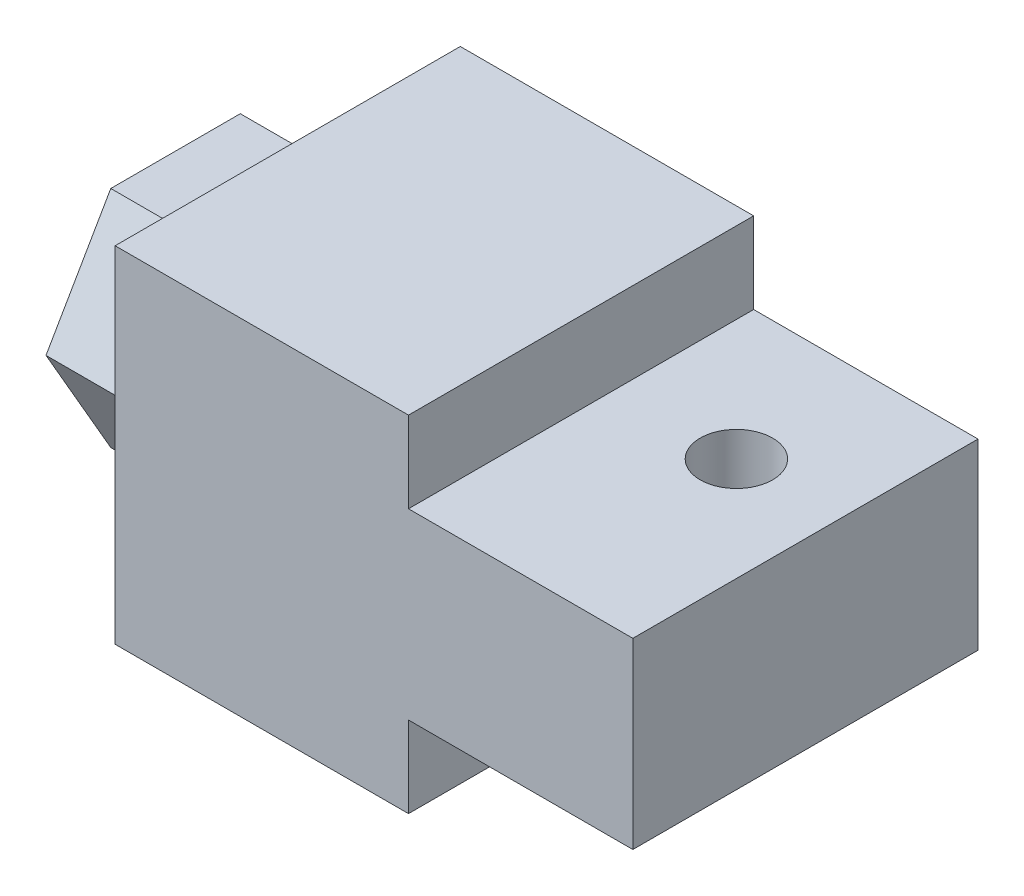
ISO-10303-21;
HEADER;
FILE_DESCRIPTION(('STEP AP214'),'2;1');
FILE_NAME('part.step','',(''),(''),'','','');
FILE_SCHEMA(('AUTOMOTIVE_DESIGN { 1 0 10303 214 1 1 1 1 }'));
ENDSEC;
DATA;
#1=APPLICATION_CONTEXT('core data for automotive mechanical design processes');
#2=APPLICATION_PROTOCOL_DEFINITION('international standard','automotive_design',2000,#1);
#3=PRODUCT_CONTEXT('',#1,'mechanical');
#4=PRODUCT('Part','Part','',(#3));
#5=PRODUCT_RELATED_PRODUCT_CATEGORY('part','',(#4));
#6=PRODUCT_DEFINITION_FORMATION('','',#4);
#7=PRODUCT_DEFINITION_CONTEXT('part definition',#1,'design');
#8=PRODUCT_DEFINITION('design','',#6,#7);
#9=PRODUCT_DEFINITION_SHAPE('','',#8);
#10=(LENGTH_UNIT() NAMED_UNIT(*) SI_UNIT(.MILLI.,.METRE.));
#11=(NAMED_UNIT(*) PLANE_ANGLE_UNIT() SI_UNIT($,.RADIAN.));
#12=(NAMED_UNIT(*) SI_UNIT($,.STERADIAN.) SOLID_ANGLE_UNIT());
#13=UNCERTAINTY_MEASURE_WITH_UNIT(LENGTH_MEASURE(1.E-05),#10,'distance_accuracy_value','');
#14=(GEOMETRIC_REPRESENTATION_CONTEXT(3) GLOBAL_UNCERTAINTY_ASSIGNED_CONTEXT((#13)) GLOBAL_UNIT_ASSIGNED_CONTEXT((#10,
#11,#12)) REPRESENTATION_CONTEXT('',''));
#15=CARTESIAN_POINT('',(0.,0.,0.));
#16=DIRECTION('',(0.,0.,1.));
#17=DIRECTION('',(1.,0.,0.));
#18=AXIS2_PLACEMENT_3D('',#15,#16,#17);
#19=CARTESIAN_POINT('',(30.,10.,10.));
#20=DIRECTION('',(0.,1.,0.));
#21=DIRECTION('',(0.,0.,-1.));
#22=AXIS2_PLACEMENT_3D('',#19,#20,#21);
#23=PLANE('',#22);
#24=DIRECTION('',(-1.,0.,0.));
#25=VECTOR('',#24,1.);
#26=CARTESIAN_POINT('',(30.,10.,10.));
#27=LINE('',#26,#25);
#28=CARTESIAN_POINT('',(17.,10.,10.));
#29=VERTEX_POINT('',#28);
#30=CARTESIAN_POINT('',(0.,10.,10.));
#31=VERTEX_POINT('',#30);
#32=EDGE_CURVE('E23',#29,#31,#27,.T.);
#33=ORIENTED_EDGE('',*,*,#32,.F.);
#34=DIRECTION('',(0.,0.,-1.));
#35=VECTOR('',#34,1.);
#36=CARTESIAN_POINT('',(17.,10.,10.));
#37=LINE('',#36,#35);
#38=CARTESIAN_POINT('',(17.,10.,-10.));
#39=VERTEX_POINT('',#38);
#40=EDGE_CURVE('E193',#29,#39,#37,.T.);
#41=ORIENTED_EDGE('',*,*,#40,.T.);
#42=DIRECTION('',(-1.,0.,0.));
#43=VECTOR('',#42,1.);
#44=CARTESIAN_POINT('',(30.,10.,-10.));
#45=LINE('',#44,#43);
#46=CARTESIAN_POINT('',(0.,10.,-10.));
#47=VERTEX_POINT('',#46);
#48=EDGE_CURVE('E227',#39,#47,#45,.T.);
#49=ORIENTED_EDGE('',*,*,#48,.T.);
#50=DIRECTION('',(0.,0.,-1.));
#51=VECTOR('',#50,1.);
#52=CARTESIAN_POINT('',(0.,10.,10.));
#53=LINE('',#52,#51);
#54=EDGE_CURVE('E210',#31,#47,#53,.T.);
#55=ORIENTED_EDGE('',*,*,#54,.F.);
#56=EDGE_LOOP('',(#33,#41,#49,#55));
#57=FACE_BOUND('',#56,.T.);
#58=ADVANCED_FACE('F14',(#57),#23,.T.);
#59=CARTESIAN_POINT('',(30.,10.,10.));
#60=DIRECTION('',(0.,0.,-1.));
#61=DIRECTION('',(1.,0.,0.));
#62=AXIS2_PLACEMENT_3D('',#59,#60,#61);
#63=PLANE('',#62);
#64=DIRECTION('',(0.,1.,0.));
#65=VECTOR('',#64,1.);
#66=CARTESIAN_POINT('',(17.,5.3,10.));
#67=LINE('',#66,#65);
#68=CARTESIAN_POINT('',(17.,5.3,10.));
#69=VERTEX_POINT('',#68);
#70=EDGE_CURVE('E181',#69,#29,#67,.T.);
#71=ORIENTED_EDGE('',*,*,#70,.T.);
#72=ORIENTED_EDGE('',*,*,#32,.T.);
#73=DIRECTION('',(0.,-1.,0.));
#74=VECTOR('',#73,1.);
#75=CARTESIAN_POINT('',(0.,10.,10.));
#76=LINE('',#75,#74);
#77=CARTESIAN_POINT('',(0.,-10.,10.));
#78=VERTEX_POINT('',#77);
#79=EDGE_CURVE('E219',#31,#78,#76,.T.);
#80=ORIENTED_EDGE('',*,*,#79,.T.);
#81=DIRECTION('',(-1.,0.,0.));
#82=VECTOR('',#81,1.);
#83=CARTESIAN_POINT('',(30.,-10.,10.));
#84=LINE('',#83,#82);
#85=CARTESIAN_POINT('',(17.,-10.,10.));
#86=VERTEX_POINT('',#85);
#87=EDGE_CURVE('E231',#86,#78,#84,.T.);
#88=ORIENTED_EDGE('',*,*,#87,.F.);
#89=DIRECTION('',(0.,-1.,0.));
#90=VECTOR('',#89,1.);
#91=CARTESIAN_POINT('',(17.,-5.3,10.));
#92=LINE('',#91,#90);
#93=CARTESIAN_POINT('',(17.,-5.3,10.));
#94=VERTEX_POINT('',#93);
#95=EDGE_CURVE('E196',#94,#86,#92,.T.);
#96=ORIENTED_EDGE('',*,*,#95,.F.);
#97=DIRECTION('',(1.,0.,0.));
#98=VECTOR('',#97,1.);
#99=CARTESIAN_POINT('',(17.,-5.3,10.));
#100=LINE('',#99,#98);
#101=CARTESIAN_POINT('',(30.,-5.3,10.));
#102=VERTEX_POINT('',#101);
#103=EDGE_CURVE('E198',#94,#102,#100,.T.);
#104=ORIENTED_EDGE('',*,*,#103,.T.);
#105=DIRECTION('',(0.,-1.,0.));
#106=VECTOR('',#105,1.);
#107=CARTESIAN_POINT('',(30.,10.,10.));
#108=LINE('',#107,#106);
#109=CARTESIAN_POINT('',(30.,5.3,10.));
#110=VERTEX_POINT('',#109);
#111=EDGE_CURVE('E225',#110,#102,#108,.T.);
#112=ORIENTED_EDGE('',*,*,#111,.F.);
#113=DIRECTION('',(1.,0.,0.));
#114=VECTOR('',#113,1.);
#115=CARTESIAN_POINT('',(17.,5.3,10.));
#116=LINE('',#115,#114);
#117=EDGE_CURVE('E184',#69,#110,#116,.T.);
#118=ORIENTED_EDGE('',*,*,#117,.F.);
#119=EDGE_LOOP('',(#71,#72,#80,#88,#96,#104,#112,#118));
#120=FACE_BOUND('',#119,.T.);
#121=ADVANCED_FACE('F16',(#120),#63,.F.);
#122=CARTESIAN_POINT('',(30.,-10.,-10.));
#123=DIRECTION('',(0.,0.,1.));
#124=DIRECTION('',(0.,1.,0.));
#125=AXIS2_PLACEMENT_3D('',#122,#123,#124);
#126=PLANE('',#125);
#127=DIRECTION('',(0.,1.,0.));
#128=VECTOR('',#127,1.);
#129=CARTESIAN_POINT('',(17.,5.3,-10.));
#130=LINE('',#129,#128);
#131=CARTESIAN_POINT('',(17.,5.3,-10.));
#132=VERTEX_POINT('',#131);
#133=EDGE_CURVE('E186',#132,#39,#130,.T.);
#134=ORIENTED_EDGE('',*,*,#133,.F.);
#135=DIRECTION('',(1.,0.,0.));
#136=VECTOR('',#135,1.);
#137=CARTESIAN_POINT('',(17.,5.3,-10.));
#138=LINE('',#137,#136);
#139=CARTESIAN_POINT('',(30.,5.3,-10.));
#140=VERTEX_POINT('',#139);
#141=EDGE_CURVE('E188',#132,#140,#138,.T.);
#142=ORIENTED_EDGE('',*,*,#141,.T.);
#143=DIRECTION('',(0.,1.,0.));
#144=VECTOR('',#143,1.);
#145=CARTESIAN_POINT('',(30.,-10.,-10.));
#146=LINE('',#145,#144);
#147=CARTESIAN_POINT('',(30.,-5.3,-10.));
#148=VERTEX_POINT('',#147);
#149=EDGE_CURVE('E222',#148,#140,#146,.T.);
#150=ORIENTED_EDGE('',*,*,#149,.F.);
#151=DIRECTION('',(1.,0.,0.));
#152=VECTOR('',#151,1.);
#153=CARTESIAN_POINT('',(17.,-5.3,-10.));
#154=LINE('',#153,#152);
#155=CARTESIAN_POINT('',(17.,-5.3,-10.));
#156=VERTEX_POINT('',#155);
#157=EDGE_CURVE('E204',#156,#148,#154,.T.);
#158=ORIENTED_EDGE('',*,*,#157,.F.);
#159=DIRECTION('',(0.,-1.,0.));
#160=VECTOR('',#159,1.);
#161=CARTESIAN_POINT('',(17.,-5.3,-10.));
#162=LINE('',#161,#160);
#163=CARTESIAN_POINT('',(17.,-10.,-10.));
#164=VERTEX_POINT('',#163);
#165=EDGE_CURVE('E201',#156,#164,#162,.T.);
#166=ORIENTED_EDGE('',*,*,#165,.T.);
#167=DIRECTION('',(-1.,0.,0.));
#168=VECTOR('',#167,1.);
#169=CARTESIAN_POINT('',(30.,-10.,-10.));
#170=LINE('',#169,#168);
#171=CARTESIAN_POINT('',(0.,-10.,-10.));
#172=VERTEX_POINT('',#171);
#173=EDGE_CURVE('E229',#164,#172,#170,.T.);
#174=ORIENTED_EDGE('',*,*,#173,.T.);
#175=DIRECTION('',(0.,1.,0.));
#176=VECTOR('',#175,1.);
#177=CARTESIAN_POINT('',(0.,-10.,-10.));
#178=LINE('',#177,#176);
#179=EDGE_CURVE('E213',#172,#47,#178,.T.);
#180=ORIENTED_EDGE('',*,*,#179,.T.);
#181=ORIENTED_EDGE('',*,*,#48,.F.);
#182=EDGE_LOOP('',(#134,#142,#150,#158,#166,#174,#180,#181));
#183=FACE_BOUND('',#182,.T.);
#184=ADVANCED_FACE('F263',(#183),#126,.F.);
#185=CARTESIAN_POINT('',(30.,10.,-10.));
#186=DIRECTION('',(1.,0.,0.));
#187=DIRECTION('',(0.,1.,0.));
#188=AXIS2_PLACEMENT_3D('',#185,#186,#187);
#189=PLANE('',#188);
#190=DIRECTION('',(0.,0.,-1.));
#191=VECTOR('',#190,1.);
#192=CARTESIAN_POINT('',(30.,5.3,-10.));
#193=LINE('',#192,#191);
#194=EDGE_CURVE('E38',#110,#140,#193,.T.);
#195=ORIENTED_EDGE('',*,*,#194,.F.);
#196=ORIENTED_EDGE('',*,*,#111,.T.);
#197=DIRECTION('',(0.,0.,-1.));
#198=VECTOR('',#197,1.);
#199=CARTESIAN_POINT('',(30.,-5.3,-10.));
#200=LINE('',#199,#198);
#201=EDGE_CURVE('E9',#102,#148,#200,.T.);
#202=ORIENTED_EDGE('',*,*,#201,.T.);
#203=ORIENTED_EDGE('',*,*,#149,.T.);
#204=EDGE_LOOP('',(#195,#196,#202,#203));
#205=FACE_BOUND('',#204,.T.);
#206=ADVANCED_FACE('F260',(#205),#189,.T.);
#207=CARTESIAN_POINT('',(30.,-10.,-10.));
#208=DIRECTION('',(0.,-1.,0.));
#209=DIRECTION('',(1.,0.,0.));
#210=AXIS2_PLACEMENT_3D('',#207,#208,#209);
#211=PLANE('',#210);
#212=DIRECTION('',(0.,0.,-1.));
#213=VECTOR('',#212,1.);
#214=CARTESIAN_POINT('',(17.,-10.,-10.));
#215=LINE('',#214,#213);
#216=EDGE_CURVE('E208',#86,#164,#215,.T.);
#217=ORIENTED_EDGE('',*,*,#216,.F.);
#218=ORIENTED_EDGE('',*,*,#87,.T.);
#219=DIRECTION('',(0.,0.,1.));
#220=VECTOR('',#219,1.);
#221=CARTESIAN_POINT('',(0.,-10.,-10.));
#222=LINE('',#221,#220);
#223=EDGE_CURVE('E216',#172,#78,#222,.T.);
#224=ORIENTED_EDGE('',*,*,#223,.F.);
#225=ORIENTED_EDGE('',*,*,#173,.F.);
#226=EDGE_LOOP('',(#217,#218,#224,#225));
#227=FACE_BOUND('',#226,.T.);
#228=ADVANCED_FACE('F247',(#227),#211,.T.);
#229=CARTESIAN_POINT('',(0.,10.,-10.));
#230=DIRECTION('',(1.,0.,0.));
#231=DIRECTION('',(0.,1.,0.));
#232=AXIS2_PLACEMENT_3D('',#229,#230,#231);
#233=PLANE('',#232);
#234=DIRECTION('',(0.,0.,-1.));
#235=VECTOR('',#234,1.);
#236=CARTESIAN_POINT('',(0.,-6.5,3.75277674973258));
#237=LINE('',#236,#235);
#238=CARTESIAN_POINT('',(0.,-6.5,3.75277674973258));
#239=VERTEX_POINT('',#238);
#240=CARTESIAN_POINT('',(0.,-6.5,-3.75277674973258));
#241=VERTEX_POINT('',#240);
#242=EDGE_CURVE('E139',#239,#241,#237,.T.);
#243=ORIENTED_EDGE('',*,*,#242,.T.);
#244=DIRECTION('',(0.,0.866025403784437,-0.5));
#245=VECTOR('',#244,1.);
#246=CARTESIAN_POINT('',(0.,-6.5,-3.75277674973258));
#247=LINE('',#246,#245);
#248=CARTESIAN_POINT('',(0.,0.,-7.50555349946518));
#249=VERTEX_POINT('',#248);
#250=EDGE_CURVE('E30',#241,#249,#247,.T.);
#251=ORIENTED_EDGE('',*,*,#250,.T.);
#252=DIRECTION('',(0.,-0.866025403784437,-0.5));
#253=VECTOR('',#252,1.);
#254=CARTESIAN_POINT('',(0.,6.5,-3.75277674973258));
#255=LINE('',#254,#253);
#256=CARTESIAN_POINT('',(0.,6.5,-3.75277674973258));
#257=VERTEX_POINT('',#256);
#258=EDGE_CURVE('E127',#257,#249,#255,.T.);
#259=ORIENTED_EDGE('',*,*,#258,.F.);
#260=DIRECTION('',(0.,0.,-1.));
#261=VECTOR('',#260,1.);
#262=CARTESIAN_POINT('',(0.,6.5,3.75277674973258));
#263=LINE('',#262,#261);
#264=CARTESIAN_POINT('',(0.,6.5,3.75277674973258));
#265=VERTEX_POINT('',#264);
#266=EDGE_CURVE('E132',#265,#257,#263,.T.);
#267=ORIENTED_EDGE('',*,*,#266,.F.);
#268=DIRECTION('',(0.,-0.866025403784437,0.5));
#269=VECTOR('',#268,1.);
#270=CARTESIAN_POINT('',(0.,6.5,3.75277674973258));
#271=LINE('',#270,#269);
#272=CARTESIAN_POINT('',(0.,0.,7.50555349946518));
#273=VERTEX_POINT('',#272);
#274=EDGE_CURVE('E148',#265,#273,#271,.T.);
#275=ORIENTED_EDGE('',*,*,#274,.T.);
#276=DIRECTION('',(0.,0.866025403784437,0.5));
#277=VECTOR('',#276,1.);
#278=CARTESIAN_POINT('',(0.,-6.5,3.75277674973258));
#279=LINE('',#278,#277);
#280=EDGE_CURVE('E151',#239,#273,#279,.T.);
#281=ORIENTED_EDGE('',*,*,#280,.F.);
#282=EDGE_LOOP('',(#243,#251,#259,#267,#275,#281));
#283=FACE_BOUND('',#282,.T.);
#284=ORIENTED_EDGE('',*,*,#54,.T.);
#285=ORIENTED_EDGE('',*,*,#179,.F.);
#286=ORIENTED_EDGE('',*,*,#223,.T.);
#287=ORIENTED_EDGE('',*,*,#79,.F.);
#288=EDGE_LOOP('',(#284,#285,#286,#287));
#289=FACE_BOUND('',#288,.T.);
#290=ADVANCED_FACE('F135',(#283,#289),#233,.F.);
#291=CARTESIAN_POINT('',(17.,-5.3,-10.));
#292=DIRECTION('',(-1.,0.,0.));
#293=DIRECTION('',(0.,-1.,0.));
#294=AXIS2_PLACEMENT_3D('',#291,#292,#293);
#295=PLANE('',#294);
#296=ORIENTED_EDGE('',*,*,#216,.T.);
#297=ORIENTED_EDGE('',*,*,#165,.F.);
#298=DIRECTION('',(0.,0.,1.));
#299=VECTOR('',#298,1.);
#300=CARTESIAN_POINT('',(17.,-5.3,-10.));
#301=LINE('',#300,#299);
#302=EDGE_CURVE('E206',#156,#94,#301,.T.);
#303=ORIENTED_EDGE('',*,*,#302,.T.);
#304=ORIENTED_EDGE('',*,*,#95,.T.);
#305=EDGE_LOOP('',(#296,#297,#303,#304));
#306=FACE_BOUND('',#305,.T.);
#307=ADVANCED_FACE('F252',(#306),#295,.F.);
#308=CARTESIAN_POINT('',(17.,-5.3,-10.));
#309=DIRECTION('',(0.,-1.,0.));
#310=DIRECTION('',(1.,0.,0.));
#311=AXIS2_PLACEMENT_3D('',#308,#309,#310);
#312=PLANE('',#311);
#313=CARTESIAN_POINT('',(24.,-5.3,-2.));
#314=DIRECTION('',(0.,-1.,0.));
#315=DIRECTION('',(1.,0.,0.));
#316=AXIS2_PLACEMENT_3D('',#313,#314,#315);
#317=CIRCLE('',#316,2.1);
#318=CARTESIAN_POINT('',(26.1,-5.3,-2.));
#319=VERTEX_POINT('',#318);
#320=EDGE_CURVE('E178',#319,#319,#317,.T.);
#321=ORIENTED_EDGE('',*,*,#320,.F.);
#322=EDGE_LOOP('',(#321));
#323=FACE_BOUND('',#322,.T.);
#324=ORIENTED_EDGE('',*,*,#103,.F.);
#325=ORIENTED_EDGE('',*,*,#302,.F.);
#326=ORIENTED_EDGE('',*,*,#157,.T.);
#327=ORIENTED_EDGE('',*,*,#201,.F.);
#328=EDGE_LOOP('',(#324,#325,#326,#327));
#329=FACE_BOUND('',#328,.T.);
#330=ADVANCED_FACE('F257',(#323,#329),#312,.T.);
#331=CARTESIAN_POINT('',(17.,5.3,-10.));
#332=DIRECTION('',(1.,0.,0.));
#333=DIRECTION('',(0.,1.,0.));
#334=AXIS2_PLACEMENT_3D('',#331,#332,#333);
#335=PLANE('',#334);
#336=ORIENTED_EDGE('',*,*,#70,.F.);
#337=DIRECTION('',(0.,0.,1.));
#338=VECTOR('',#337,1.);
#339=CARTESIAN_POINT('',(17.,5.3,-10.));
#340=LINE('',#339,#338);
#341=EDGE_CURVE('E190',#132,#69,#340,.T.);
#342=ORIENTED_EDGE('',*,*,#341,.F.);
#343=ORIENTED_EDGE('',*,*,#133,.T.);
#344=ORIENTED_EDGE('',*,*,#40,.F.);
#345=EDGE_LOOP('',(#336,#342,#343,#344));
#346=FACE_BOUND('',#345,.T.);
#347=ADVANCED_FACE('F266',(#346),#335,.T.);
#348=CARTESIAN_POINT('',(17.,5.3,-10.));
#349=DIRECTION('',(0.,-1.,0.));
#350=DIRECTION('',(1.,0.,0.));
#351=AXIS2_PLACEMENT_3D('',#348,#349,#350);
#352=PLANE('',#351);
#353=CARTESIAN_POINT('',(24.,5.3,-2.));
#354=DIRECTION('',(0.,-1.,0.));
#355=DIRECTION('',(1.,0.,0.));
#356=AXIS2_PLACEMENT_3D('',#353,#354,#355);
#357=CIRCLE('',#356,2.1);
#358=CARTESIAN_POINT('',(26.1,5.3,-2.));
#359=VERTEX_POINT('',#358);
#360=EDGE_CURVE('E18',#359,#359,#357,.T.);
#361=ORIENTED_EDGE('',*,*,#360,.T.);
#362=EDGE_LOOP('',(#361));
#363=FACE_BOUND('',#362,.T.);
#364=ORIENTED_EDGE('',*,*,#194,.T.);
#365=ORIENTED_EDGE('',*,*,#141,.F.);
#366=ORIENTED_EDGE('',*,*,#341,.T.);
#367=ORIENTED_EDGE('',*,*,#117,.T.);
#368=EDGE_LOOP('',(#364,#365,#366,#367));
#369=FACE_BOUND('',#368,.T.);
#370=ADVANCED_FACE('F264',(#363,#369),#352,.F.);
#371=CARTESIAN_POINT('',(24.,10.,-2.));
#372=DIRECTION('',(0.,-1.,0.));
#373=DIRECTION('',(1.,0.,0.));
#374=AXIS2_PLACEMENT_3D('',#371,#372,#373);
#375=CYLINDRICAL_SURFACE('',#374,2.1);
#376=ORIENTED_EDGE('',*,*,#320,.T.);
#377=EDGE_LOOP('',(#376));
#378=FACE_BOUND('',#377,.T.);
#379=ORIENTED_EDGE('',*,*,#360,.F.);
#380=EDGE_LOOP('',(#379));
#381=FACE_BOUND('',#380,.T.);
#382=ADVANCED_FACE('F275',(#378,#381),#375,.F.);
#383=CARTESIAN_POINT('',(-6.5,-6.5,-3.75277674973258));
#384=DIRECTION('',(0.,-0.5,-0.866025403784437));
#385=DIRECTION('',(0.,-0.866025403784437,0.5));
#386=AXIS2_PLACEMENT_3D('',#383,#384,#385);
#387=PLANE('',#386);
#388=DIRECTION('',(1.,0.,0.));
#389=VECTOR('',#388,1.);
#390=CARTESIAN_POINT('',(-6.5,-6.5,-3.75277674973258));
#391=LINE('',#390,#389);
#392=CARTESIAN_POINT('',(-6.5,-6.5,-3.75277674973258));
#393=VERTEX_POINT('',#392);
#394=EDGE_CURVE('E176',#393,#241,#391,.T.);
#395=ORIENTED_EDGE('',*,*,#394,.F.);
#396=DIRECTION('',(0.,0.866025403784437,-0.5));
#397=VECTOR('',#396,1.);
#398=CARTESIAN_POINT('',(-6.5,-6.5,-3.75277674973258));
#399=LINE('',#398,#397);
#400=CARTESIAN_POINT('',(-6.5,0.,-7.50555349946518));
#401=VERTEX_POINT('',#400);
#402=EDGE_CURVE('E119',#393,#401,#399,.T.);
#403=ORIENTED_EDGE('',*,*,#402,.T.);
#404=DIRECTION('',(1.,0.,0.));
#405=VECTOR('',#404,1.);
#406=CARTESIAN_POINT('',(-6.5,0.,-7.50555349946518));
#407=LINE('',#406,#405);
#408=EDGE_CURVE('E115',#401,#249,#407,.T.);
#409=ORIENTED_EDGE('',*,*,#408,.T.);
#410=ORIENTED_EDGE('',*,*,#250,.F.);
#411=EDGE_LOOP('',(#395,#403,#409,#410));
#412=FACE_BOUND('',#411,.T.);
#413=ADVANCED_FACE('F117',(#412),#387,.T.);
#414=CARTESIAN_POINT('',(-6.5,-6.5,3.75277674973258));
#415=DIRECTION('',(0.,-1.,0.));
#416=DIRECTION('',(1.,0.,0.));
#417=AXIS2_PLACEMENT_3D('',#414,#415,#416);
#418=PLANE('',#417);
#419=DIRECTION('',(1.,0.,0.));
#420=VECTOR('',#419,1.);
#421=CARTESIAN_POINT('',(-6.5,-6.5,3.75277674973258));
#422=LINE('',#421,#420);
#423=CARTESIAN_POINT('',(-6.5,-6.5,3.75277674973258));
#424=VERTEX_POINT('',#423);
#425=EDGE_CURVE('E174',#424,#239,#422,.T.);
#426=ORIENTED_EDGE('',*,*,#425,.F.);
#427=DIRECTION('',(0.,0.,-1.));
#428=VECTOR('',#427,1.);
#429=CARTESIAN_POINT('',(-6.5,-6.5,3.75277674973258));
#430=LINE('',#429,#428);
#431=EDGE_CURVE('E124',#424,#393,#430,.T.);
#432=ORIENTED_EDGE('',*,*,#431,.T.);
#433=ORIENTED_EDGE('',*,*,#394,.T.);
#434=ORIENTED_EDGE('',*,*,#242,.F.);
#435=EDGE_LOOP('',(#426,#432,#433,#434));
#436=FACE_BOUND('',#435,.T.);
#437=ADVANCED_FACE('F353',(#436),#418,.T.);
#438=CARTESIAN_POINT('',(-6.5,-6.5,3.75277674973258));
#439=DIRECTION('',(0.,0.5,-0.866025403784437));
#440=DIRECTION('',(0.,-0.866025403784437,-0.5));
#441=AXIS2_PLACEMENT_3D('',#438,#439,#440);
#442=PLANE('',#441);
#443=DIRECTION('',(1.,0.,0.));
#444=VECTOR('',#443,1.);
#445=CARTESIAN_POINT('',(-6.5,0.,7.50555349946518));
#446=LINE('',#445,#444);
#447=CARTESIAN_POINT('',(-6.5,0.,7.50555349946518));
#448=VERTEX_POINT('',#447);
#449=EDGE_CURVE('E172',#448,#273,#446,.T.);
#450=ORIENTED_EDGE('',*,*,#449,.F.);
#451=DIRECTION('',(0.,0.866025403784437,0.5));
#452=VECTOR('',#451,1.);
#453=CARTESIAN_POINT('',(-6.5,-6.5,3.75277674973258));
#454=LINE('',#453,#452);
#455=EDGE_CURVE('E164',#424,#448,#454,.T.);
#456=ORIENTED_EDGE('',*,*,#455,.F.);
#457=ORIENTED_EDGE('',*,*,#425,.T.);
#458=ORIENTED_EDGE('',*,*,#280,.T.);
#459=EDGE_LOOP('',(#450,#456,#457,#458));
#460=FACE_BOUND('',#459,.T.);
#461=ADVANCED_FACE('F361',(#460),#442,.F.);
#462=CARTESIAN_POINT('',(-6.5,6.5,3.75277674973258));
#463=DIRECTION('',(0.,0.5,0.866025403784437));
#464=DIRECTION('',(0.,0.866025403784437,-0.5));
#465=AXIS2_PLACEMENT_3D('',#462,#463,#464);
#466=PLANE('',#465);
#467=DIRECTION('',(1.,0.,0.));
#468=VECTOR('',#467,1.);
#469=CARTESIAN_POINT('',(-6.5,6.5,3.75277674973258));
#470=LINE('',#469,#468);
#471=CARTESIAN_POINT('',(-6.5,6.5,3.75277674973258));
#472=VERTEX_POINT('',#471);
#473=EDGE_CURVE('E170',#472,#265,#470,.T.);
#474=ORIENTED_EDGE('',*,*,#473,.F.);
#475=DIRECTION('',(0.,-0.866025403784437,0.5));
#476=VECTOR('',#475,1.);
#477=CARTESIAN_POINT('',(-6.5,6.5,3.75277674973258));
#478=LINE('',#477,#476);
#479=EDGE_CURVE('E161',#472,#448,#478,.T.);
#480=ORIENTED_EDGE('',*,*,#479,.T.);
#481=ORIENTED_EDGE('',*,*,#449,.T.);
#482=ORIENTED_EDGE('',*,*,#274,.F.);
#483=EDGE_LOOP('',(#474,#480,#481,#482));
#484=FACE_BOUND('',#483,.T.);
#485=ADVANCED_FACE('F370',(#484),#466,.T.);
#486=CARTESIAN_POINT('',(-6.5,6.5,3.75277674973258));
#487=DIRECTION('',(0.,-1.,0.));
#488=DIRECTION('',(1.,0.,0.));
#489=AXIS2_PLACEMENT_3D('',#486,#487,#488);
#490=PLANE('',#489);
#491=DIRECTION('',(1.,0.,0.));
#492=VECTOR('',#491,1.);
#493=CARTESIAN_POINT('',(-6.5,6.5,-3.75277674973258));
#494=LINE('',#493,#492);
#495=CARTESIAN_POINT('',(-6.5,6.5,-3.75277674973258));
#496=VERTEX_POINT('',#495);
#497=EDGE_CURVE('E123',#496,#257,#494,.T.);
#498=ORIENTED_EDGE('',*,*,#497,.F.);
#499=DIRECTION('',(0.,0.,-1.));
#500=VECTOR('',#499,1.);
#501=CARTESIAN_POINT('',(-6.5,6.5,3.75277674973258));
#502=LINE('',#501,#500);
#503=EDGE_CURVE('E158',#472,#496,#502,.T.);
#504=ORIENTED_EDGE('',*,*,#503,.F.);
#505=ORIENTED_EDGE('',*,*,#473,.T.);
#506=ORIENTED_EDGE('',*,*,#266,.T.);
#507=EDGE_LOOP('',(#498,#504,#505,#506));
#508=FACE_BOUND('',#507,.T.);
#509=ADVANCED_FACE('F379',(#508),#490,.F.);
#510=CARTESIAN_POINT('',(-6.5,6.5,-3.75277674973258));
#511=DIRECTION('',(0.,-0.5,0.866025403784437));
#512=DIRECTION('',(0.,0.866025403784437,0.5));
#513=AXIS2_PLACEMENT_3D('',#510,#511,#512);
#514=PLANE('',#513);
#515=DIRECTION('',(0.,-0.866025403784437,-0.5));
#516=VECTOR('',#515,1.);
#517=CARTESIAN_POINT('',(-6.5,6.5,-3.75277674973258));
#518=LINE('',#517,#516);
#519=EDGE_CURVE('E156',#496,#401,#518,.T.);
#520=ORIENTED_EDGE('',*,*,#519,.F.);
#521=ORIENTED_EDGE('',*,*,#497,.T.);
#522=ORIENTED_EDGE('',*,*,#258,.T.);
#523=ORIENTED_EDGE('',*,*,#408,.F.);
#524=EDGE_LOOP('',(#520,#521,#522,#523));
#525=FACE_BOUND('',#524,.T.);
#526=ADVANCED_FACE('F128',(#525),#514,.F.);
#527=CARTESIAN_POINT('',(-6.5,0.,-7.50555349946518));
#528=DIRECTION('',(-1.,0.,0.));
#529=DIRECTION('',(0.,-1.,0.));
#530=AXIS2_PLACEMENT_3D('',#527,#528,#529);
#531=PLANE('',#530);
#532=CARTESIAN_POINT('',(-6.5,0.,0.));
#533=DIRECTION('',(-1.,0.,0.));
#534=DIRECTION('',(0.,-1.,0.));
#535=AXIS2_PLACEMENT_3D('',#532,#533,#534);
#536=CIRCLE('',#535,4.);
#537=CARTESIAN_POINT('',(-6.5,-4.,0.));
#538=VERTEX_POINT('',#537);
#539=EDGE_CURVE('E140',#538,#538,#536,.T.);
#540=ORIENTED_EDGE('',*,*,#539,.F.);
#541=EDGE_LOOP('',(#540));
#542=FACE_BOUND('',#541,.T.);
#543=ORIENTED_EDGE('',*,*,#402,.F.);
#544=ORIENTED_EDGE('',*,*,#431,.F.);
#545=ORIENTED_EDGE('',*,*,#455,.T.);
#546=ORIENTED_EDGE('',*,*,#479,.F.);
#547=ORIENTED_EDGE('',*,*,#503,.T.);
#548=ORIENTED_EDGE('',*,*,#519,.T.);
#549=EDGE_LOOP('',(#543,#544,#545,#546,#547,#548));
#550=FACE_BOUND('',#549,.T.);
#551=ADVANCED_FACE('F390',(#542,#550),#531,.T.);
#552=CARTESIAN_POINT('',(11.,0.,0.));
#553=DIRECTION('',(-1.,0.,0.));
#554=DIRECTION('',(0.,-1.,0.));
#555=AXIS2_PLACEMENT_3D('',#552,#553,#554);
#556=CYLINDRICAL_SURFACE('',#555,4.);
#557=ORIENTED_EDGE('',*,*,#539,.T.);
#558=EDGE_LOOP('',(#557));
#559=FACE_BOUND('',#558,.T.);
#560=CARTESIAN_POINT('',(12.5,0.,0.));
#561=DIRECTION('',(-1.,0.,0.));
#562=DIRECTION('',(0.,0.,1.));
#563=AXIS2_PLACEMENT_3D('',#560,#561,#562);
#564=CIRCLE('',#563,4.);
#565=CARTESIAN_POINT('',(12.5,0.,4.));
#566=VERTEX_POINT('',#565);
#567=EDGE_CURVE('E143',#566,#566,#564,.T.);
#568=ORIENTED_EDGE('',*,*,#567,.F.);
#569=EDGE_LOOP('',(#568));
#570=FACE_BOUND('',#569,.T.);
#571=ADVANCED_FACE('F398',(#559,#570),#556,.F.);
#572=CARTESIAN_POINT('',(12.5,0.,0.));
#573=DIRECTION('',(-1.,0.,0.));
#574=DIRECTION('',(0.,0.,1.));
#575=AXIS2_PLACEMENT_3D('',#572,#573,#574);
#576=PLANE('',#575);
#577=ORIENTED_EDGE('',*,*,#567,.T.);
#578=EDGE_LOOP('',(#577));
#579=FACE_BOUND('',#578,.T.);
#580=ADVANCED_FACE('F413',(#579),#576,.T.);
#581=CLOSED_SHELL('',(#58,#121,#184,#206,#228,#290,#307,#330,#347,#370,#382,#413,#437,#461,#485,
#509,#526,#551,#571,#580));
#582=MANIFOLD_SOLID_BREP('B1',#581);
#583=ADVANCED_BREP_SHAPE_REPRESENTATION('',(#18,#582),#14);
#584=SHAPE_DEFINITION_REPRESENTATION(#9,#583);
ENDSEC;
END-ISO-10303-21;
